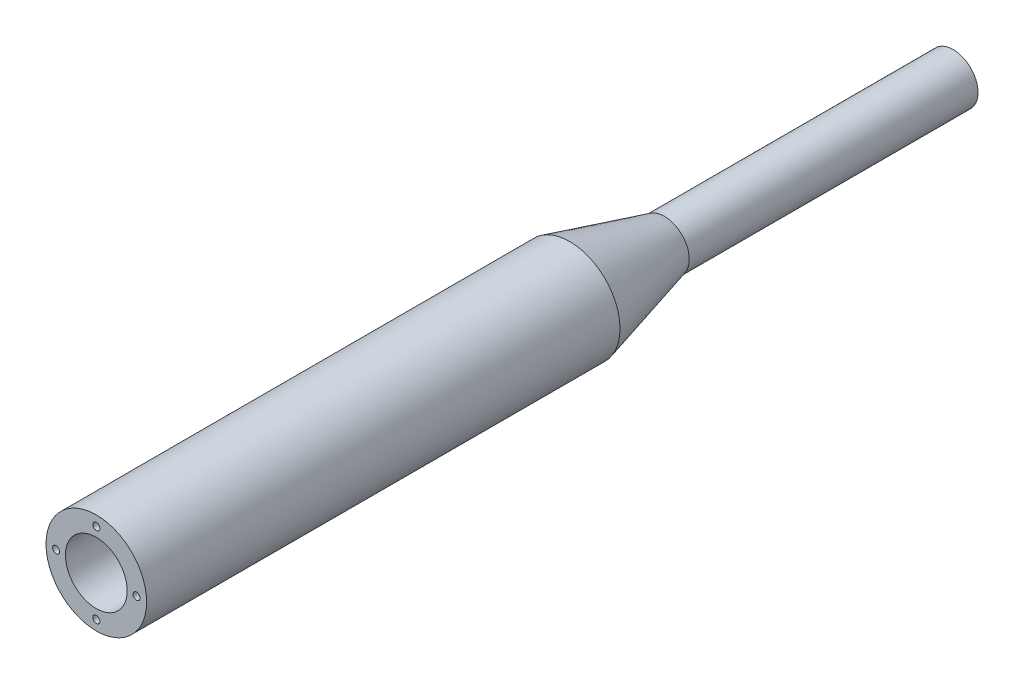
from build123d import *

# Parameters (mm, degrees)
SKETCH1_R                  = 26.9875
BOSS_EXTRUDE1_DEPTH        = 254
SKETCH2_R                  = 13.335
SKETCH2_R_2                = 6.35
BOSS_EXTRUDE2_DEPTH        = 205.74
F_1_1_DIAMETER_HOLE1_D     = 31.75
F_1_1_DIAMETER_HOLE1_DEPTH = 254
F_1_1_DIAMETER_HOLE1_TIP   = 9.538662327
SKETCH8_R                  = 16.5735
CUT_EXTRUDE1_DEPTH         = 25.4
F_10_24_TAPPED_HOLE1_D     = 3.7973
F_10_24_TAPPED_HOLE1_DEPTH = 25.4
F_10_24_TAPPED_HOLE1_TIP   = 1.140824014


with BuildPart() as part:
    # Sketch1 → Boss-Extrude1 (new body)
    with BuildSketch(Plane.XY):
        Circle(SKETCH1_R)
    extrude(amount=BOSS_EXTRUDE1_DEPTH)



with BuildPart() as body_2:
    # Sketch2 → Boss-Extrude2 (new body)
    with BuildSketch(Plane(origin=(0, 0, 0), x_dir=(-1, 0, 0), z_dir=(0, 0, -1))):
        Circle(SKETCH2_R)
        Circle(SKETCH2_R_2, mode=Mode.SUBTRACT)
    extrude(amount=BOSS_EXTRUDE2_DEPTH)


with BuildPart() as part_1:
    add(part.part)

    add(body_2.part)  # Revolve1 merges body 2
    # Sketch4 → Revolve1 (revolve)
    with BuildSketch(Plane(origin=(0, 0, 0), x_dir=(0, 0, -1), z_dir=(1, 0, 0)), mode=Mode.PRIVATE) as revolve1_sk:
        Polygon((0, 26.9875), (0, 13.335), (50.8, 13.335), align=None)
    revolve(revolve1_sk.sketch.rotate(Axis((0, 0, -205.74), (0, 0, 1)), 90), axis=Axis((0, 0, -205.74), (0, 0, 1)))

    # 1 _1_ Diameter Hole1
    with Locations(Plane.XY.offset(254)):
        with Locations((0, 0)):
            Hole(F_1_1_DIAMETER_HOLE1_D / 2, depth=F_1_1_DIAMETER_HOLE1_DEPTH)
            with Locations((0, 0, -(F_1_1_DIAMETER_HOLE1_DEPTH + F_1_1_DIAMETER_HOLE1_TIP / 2))):  # 118° drill point
                Cone(0, F_1_1_DIAMETER_HOLE1_D / 2, F_1_1_DIAMETER_HOLE1_TIP, mode=Mode.SUBTRACT)

    # Sketch8 → Cut-Extrude1 (cut)
    with BuildSketch(Plane.XY.offset(254)):
        Circle(SKETCH8_R)
    extrude(amount=-CUT_EXTRUDE1_DEPTH, mode=Mode.SUBTRACT)

    # 10-24 Tapped Hole1
    with Locations(Plane.XY.offset(254)):
        with Locations((0, 21.59), (-21.59, 0), (0, -21.59), (21.59, 0)):
            Hole(F_10_24_TAPPED_HOLE1_D / 2, depth=F_10_24_TAPPED_HOLE1_DEPTH)
            with Locations((0, 0, -(F_10_24_TAPPED_HOLE1_DEPTH + F_10_24_TAPPED_HOLE1_TIP / 2))):  # 118° drill point
                Cone(0, F_10_24_TAPPED_HOLE1_D / 2, F_10_24_TAPPED_HOLE1_TIP, mode=Mode.SUBTRACT)


solid = part_1.part
